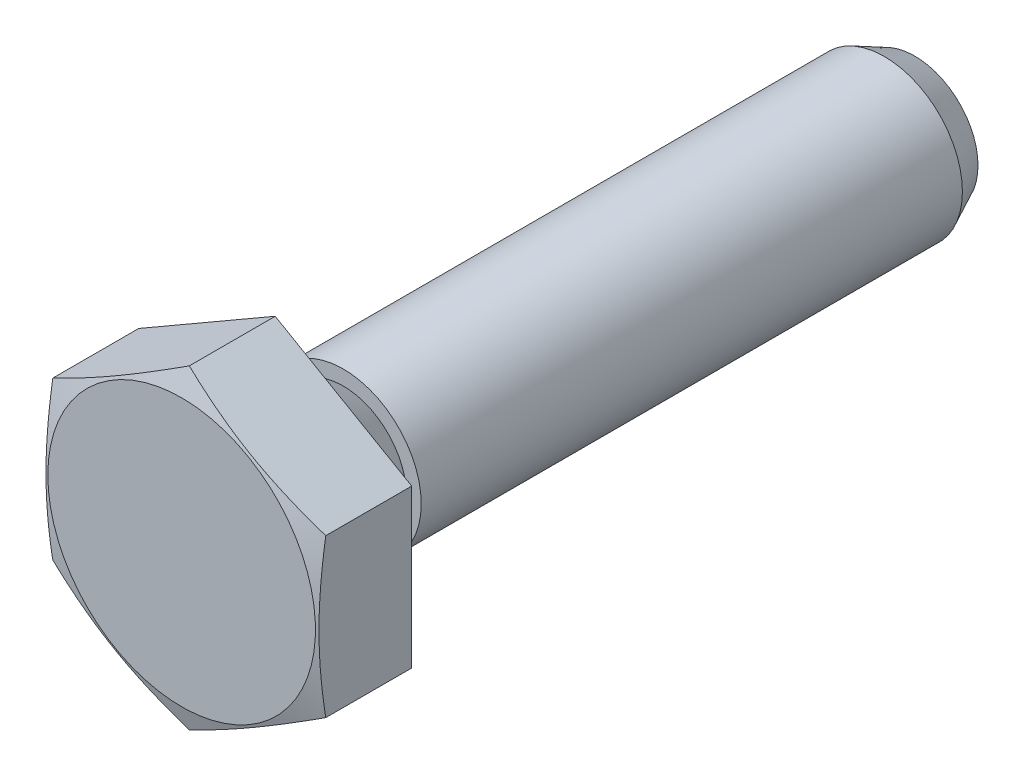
ISO-10303-21;
HEADER;
FILE_DESCRIPTION(('STEP AP214'),'2;1');
FILE_NAME('part.step','',(''),(''),'','','');
FILE_SCHEMA(('AUTOMOTIVE_DESIGN { 1 0 10303 214 1 1 1 1 }'));
ENDSEC;
DATA;
#1=APPLICATION_CONTEXT('core data for automotive mechanical design processes');
#2=APPLICATION_PROTOCOL_DEFINITION('international standard','automotive_design',2000,#1);
#3=PRODUCT_CONTEXT('',#1,'mechanical');
#4=PRODUCT('Part','Part','',(#3));
#5=PRODUCT_RELATED_PRODUCT_CATEGORY('part','',(#4));
#6=PRODUCT_DEFINITION_FORMATION('','',#4);
#7=PRODUCT_DEFINITION_CONTEXT('part definition',#1,'design');
#8=PRODUCT_DEFINITION('design','',#6,#7);
#9=PRODUCT_DEFINITION_SHAPE('','',#8);
#10=(LENGTH_UNIT() NAMED_UNIT(*) SI_UNIT(.MILLI.,.METRE.));
#11=(NAMED_UNIT(*) PLANE_ANGLE_UNIT() SI_UNIT($,.RADIAN.));
#12=(NAMED_UNIT(*) SI_UNIT($,.STERADIAN.) SOLID_ANGLE_UNIT());
#13=UNCERTAINTY_MEASURE_WITH_UNIT(LENGTH_MEASURE(1.E-05),#10,'distance_accuracy_value','');
#14=(GEOMETRIC_REPRESENTATION_CONTEXT(3) GLOBAL_UNCERTAINTY_ASSIGNED_CONTEXT((#13)) GLOBAL_UNIT_ASSIGNED_CONTEXT((#10,
#11,#12)) REPRESENTATION_CONTEXT('',''));
#15=CARTESIAN_POINT('',(0.,0.,0.));
#16=DIRECTION('',(0.,0.,1.));
#17=DIRECTION('',(1.,0.,0.));
#18=AXIS2_PLACEMENT_3D('',#15,#16,#17);
#19=CARTESIAN_POINT('',(0.,0.,0.399999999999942));
#20=DIRECTION('',(0.,0.,1.));
#21=DIRECTION('',(1.,0.,0.));
#22=AXIS2_PLACEMENT_3D('',#19,#20,#21);
#23=TOROIDAL_SURFACE('',#22,2.55,0.4);
#24=CARTESIAN_POINT('',(0.,0.,0.399999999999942));
#25=DIRECTION('',(0.,0.,1.));
#26=DIRECTION('',(1.,0.,0.));
#27=AXIS2_PLACEMENT_3D('',#24,#25,#26);
#28=CIRCLE('',#27,2.95);
#29=CARTESIAN_POINT('',(2.95,0.,0.399999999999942));
#30=VERTEX_POINT('',#29);
#31=EDGE_CURVE('E11',#30,#30,#28,.T.);
#32=ORIENTED_EDGE('',*,*,#31,.F.);
#33=EDGE_LOOP('',(#32));
#34=FACE_BOUND('',#33,.T.);
#35=CARTESIAN_POINT('',(0.,0.,0.));
#36=DIRECTION('',(0.,0.,1.));
#37=DIRECTION('',(1.,0.,0.));
#38=AXIS2_PLACEMENT_3D('',#35,#36,#37);
#39=CIRCLE('',#38,2.55);
#40=CARTESIAN_POINT('',(2.55,0.,0.));
#41=VERTEX_POINT('',#40);
#42=EDGE_CURVE('E24',#41,#41,#39,.T.);
#43=ORIENTED_EDGE('',*,*,#42,.T.);
#44=EDGE_LOOP('',(#43));
#45=FACE_BOUND('',#44,.T.);
#46=ADVANCED_FACE('F17',(#34,#45),#23,.T.);
#47=CARTESIAN_POINT('',(0.,2.55,0.));
#48=DIRECTION('',(0.,0.,-1.));
#49=DIRECTION('',(-1.,0.,0.));
#50=AXIS2_PLACEMENT_3D('',#47,#48,#49);
#51=PLANE('',#50);
#52=CARTESIAN_POINT('',(0.,0.,0.));
#53=DIRECTION('',(0.,0.,1.));
#54=DIRECTION('',(1.,0.,0.));
#55=AXIS2_PLACEMENT_3D('',#52,#53,#54);
#56=CIRCLE('',#55,2.2);
#57=CARTESIAN_POINT('',(2.2,0.,0.));
#58=VERTEX_POINT('',#57);
#59=EDGE_CURVE('E118',#58,#58,#56,.T.);
#60=ORIENTED_EDGE('',*,*,#59,.T.);
#61=EDGE_LOOP('',(#60));
#62=FACE_BOUND('',#61,.T.);
#63=ORIENTED_EDGE('',*,*,#42,.F.);
#64=EDGE_LOOP('',(#63));
#65=FACE_BOUND('',#64,.T.);
#66=ADVANCED_FACE('F124',(#62,#65),#51,.T.);
#67=CARTESIAN_POINT('',(0.,0.,-0.200000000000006));
#68=DIRECTION('',(0.,0.,1.));
#69=DIRECTION('',(1.,0.,0.));
#70=AXIS2_PLACEMENT_3D('',#67,#68,#69);
#71=TOROIDAL_SURFACE('',#70,2.2,0.2);
#72=CARTESIAN_POINT('',(0.,0.,-0.200000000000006));
#73=DIRECTION('',(0.,0.,1.));
#74=DIRECTION('',(1.,0.,0.));
#75=AXIS2_PLACEMENT_3D('',#72,#73,#74);
#76=CIRCLE('',#75,2.);
#77=CARTESIAN_POINT('',(1.99999999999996,0.,-0.200000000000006));
#78=VERTEX_POINT('',#77);
#79=EDGE_CURVE('E115',#78,#78,#76,.T.);
#80=ORIENTED_EDGE('',*,*,#79,.T.);
#81=EDGE_LOOP('',(#80));
#82=FACE_BOUND('',#81,.T.);
#83=ORIENTED_EDGE('',*,*,#59,.F.);
#84=EDGE_LOOP('',(#83));
#85=FACE_BOUND('',#84,.T.);
#86=ADVANCED_FACE('F126',(#82,#85),#71,.F.);
#87=CARTESIAN_POINT('',(0.,0.,0.399999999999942));
#88=DIRECTION('',(0.,0.,1.));
#89=DIRECTION('',(1.,0.,0.));
#90=AXIS2_PLACEMENT_3D('',#87,#88,#89);
#91=CYLINDRICAL_SURFACE('',#90,2.);
#92=CARTESIAN_POINT('',(0.,-1.66533453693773E-13,-0.687769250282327));
#93=DIRECTION('',(0.,0.,1.));
#94=DIRECTION('',(1.,0.,0.));
#95=AXIS2_PLACEMENT_3D('',#92,#93,#94);
#96=CIRCLE('',#95,2.);
#97=CARTESIAN_POINT('',(2.,-1.66371690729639E-13,-0.687769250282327));
#98=VERTEX_POINT('',#97);
#99=EDGE_CURVE('E112',#98,#98,#96,.T.);
#100=ORIENTED_EDGE('',*,*,#99,.T.);
#101=EDGE_LOOP('',(#100));
#102=FACE_BOUND('',#101,.T.);
#103=ORIENTED_EDGE('',*,*,#79,.F.);
#104=EDGE_LOOP('',(#103));
#105=FACE_BOUND('',#104,.T.);
#106=ADVANCED_FACE('F133',(#102,#105),#91,.T.);
#107=CARTESIAN_POINT('',(0.,-1.66533453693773E-13,-0.687769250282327));
#108=DIRECTION('',(0.,0.,1.));
#109=DIRECTION('',(1.,0.,0.));
#110=AXIS2_PLACEMENT_3D('',#107,#108,#109);
#111=CONICAL_SURFACE('',#110,2.,0.523598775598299);
#112=CARTESIAN_POINT('',(0.,0.,-1.34400000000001));
#113=DIRECTION('',(0.,0.,1.));
#114=DIRECTION('',(1.,0.,0.));
#115=AXIS2_PLACEMENT_3D('',#112,#113,#114);
#116=CIRCLE('',#115,1.621125);
#117=CARTESIAN_POINT('',(1.621125,0.,-1.34400000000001));
#118=VERTEX_POINT('',#117);
#119=EDGE_CURVE('E109',#118,#118,#116,.T.);
#120=ORIENTED_EDGE('',*,*,#119,.T.);
#121=EDGE_LOOP('',(#120));
#122=FACE_BOUND('',#121,.T.);
#123=ORIENTED_EDGE('',*,*,#99,.F.);
#124=EDGE_LOOP('',(#123));
#125=FACE_BOUND('',#124,.T.);
#126=ADVANCED_FACE('F140',(#122,#125),#111,.T.);
#127=CARTESIAN_POINT('',(0.,1.621125,-1.34400000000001));
#128=DIRECTION('',(0.,0.,1.));
#129=DIRECTION('',(1.,0.,0.));
#130=AXIS2_PLACEMENT_3D('',#127,#128,#129);
#131=PLANE('',#130);
#132=CARTESIAN_POINT('',(0.,0.,-1.34400000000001));
#133=DIRECTION('',(0.,0.,1.));
#134=DIRECTION('',(1.,0.,0.));
#135=AXIS2_PLACEMENT_3D('',#132,#133,#134);
#136=CIRCLE('',#135,2.);
#137=CARTESIAN_POINT('',(2.,0.,-1.34400000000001));
#138=VERTEX_POINT('',#137);
#139=EDGE_CURVE('E106',#138,#138,#136,.T.);
#140=ORIENTED_EDGE('',*,*,#139,.T.);
#141=EDGE_LOOP('',(#140));
#142=FACE_BOUND('',#141,.T.);
#143=ORIENTED_EDGE('',*,*,#119,.F.);
#144=EDGE_LOOP('',(#143));
#145=FACE_BOUND('',#144,.T.);
#146=ADVANCED_FACE('F144',(#142,#145),#131,.T.);
#147=CARTESIAN_POINT('',(0.,0.,0.399999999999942));
#148=DIRECTION('',(0.,0.,1.));
#149=DIRECTION('',(1.,0.,0.));
#150=AXIS2_PLACEMENT_3D('',#147,#148,#149);
#151=CYLINDRICAL_SURFACE('',#150,2.);
#152=CARTESIAN_POINT('',(0.,0.,-15.221125));
#153=DIRECTION('',(0.,0.,1.));
#154=DIRECTION('',(1.,0.,0.));
#155=AXIS2_PLACEMENT_3D('',#152,#153,#154);
#156=CIRCLE('',#155,2.);
#157=CARTESIAN_POINT('',(2.,0.,-15.221125));
#158=VERTEX_POINT('',#157);
#159=EDGE_CURVE('E103',#158,#158,#156,.T.);
#160=ORIENTED_EDGE('',*,*,#159,.T.);
#161=EDGE_LOOP('',(#160));
#162=FACE_BOUND('',#161,.T.);
#163=ORIENTED_EDGE('',*,*,#139,.F.);
#164=EDGE_LOOP('',(#163));
#165=FACE_BOUND('',#164,.T.);
#166=ADVANCED_FACE('F148',(#162,#165),#151,.T.);
#167=CARTESIAN_POINT('',(0.,0.,-15.221125));
#168=DIRECTION('',(0.,0.,1.));
#169=DIRECTION('',(1.,0.,0.));
#170=AXIS2_PLACEMENT_3D('',#167,#168,#169);
#171=CONICAL_SURFACE('',#170,2.,0.45273988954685);
#172=CARTESIAN_POINT('',(0.,3.33066907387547E-13,-16.0000000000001));
#173=DIRECTION('',(0.,0.,1.));
#174=DIRECTION('',(1.,0.,0.));
#175=AXIS2_PLACEMENT_3D('',#172,#173,#174);
#176=CIRCLE('',#175,1.621125);
#177=CARTESIAN_POINT('',(1.621125,3.33198026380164E-13,-16.0000000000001));
#178=VERTEX_POINT('',#177);
#179=EDGE_CURVE('E100',#178,#178,#176,.T.);
#180=ORIENTED_EDGE('',*,*,#179,.T.);
#181=EDGE_LOOP('',(#180));
#182=FACE_BOUND('',#181,.T.);
#183=ORIENTED_EDGE('',*,*,#159,.F.);
#184=EDGE_LOOP('',(#183));
#185=FACE_BOUND('',#184,.T.);
#186=ADVANCED_FACE('F152',(#182,#185),#171,.T.);
#187=CARTESIAN_POINT('',(0.,1.62112499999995,-16.0000000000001));
#188=DIRECTION('',(0.,0.,-1.));
#189=DIRECTION('',(-1.,0.,0.));
#190=AXIS2_PLACEMENT_3D('',#187,#188,#189);
#191=PLANE('',#190);
#192=ORIENTED_EDGE('',*,*,#179,.F.);
#193=EDGE_LOOP('',(#192));
#194=FACE_BOUND('',#193,.T.);
#195=ADVANCED_FACE('F156',(#194),#191,.T.);
#196=CARTESIAN_POINT('',(-3.5,-2.020725,0.399999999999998));
#197=DIRECTION('',(0.,0.,-1.));
#198=DIRECTION('',(-1.,0.,0.));
#199=AXIS2_PLACEMENT_3D('',#196,#197,#198);
#200=PLANE('',#199);
#201=DIRECTION('',(0.,-1.,0.));
#202=VECTOR('',#201,1.);
#203=CARTESIAN_POINT('',(-3.50000000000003,2.020725,0.399999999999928));
#204=LINE('',#203,#202);
#205=CARTESIAN_POINT('',(-3.50000000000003,2.020725,0.399999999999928));
#206=VERTEX_POINT('',#205);
#207=CARTESIAN_POINT('',(-3.5,-2.020725,0.399999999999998));
#208=VERTEX_POINT('',#207);
#209=EDGE_CURVE('E83',#206,#208,#204,.T.);
#210=ORIENTED_EDGE('',*,*,#209,.F.);
#211=DIRECTION('',(0.866025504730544,0.49999982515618,0.));
#212=VECTOR('',#211,1.);
#213=CARTESIAN_POINT('',(-3.50000000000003,2.020725,0.399999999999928));
#214=LINE('',#213,#212);
#215=CARTESIAN_POINT('',(0.,4.04145,0.400000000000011));
#216=VERTEX_POINT('',#215);
#217=EDGE_CURVE('E88',#206,#216,#214,.T.);
#218=ORIENTED_EDGE('',*,*,#217,.T.);
#219=DIRECTION('',(0.866025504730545,-0.49999982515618,0.));
#220=VECTOR('',#219,1.);
#221=CARTESIAN_POINT('',(0.,4.04145,0.400000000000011));
#222=LINE('',#221,#220);
#223=CARTESIAN_POINT('',(3.50000000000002,2.020725,0.399999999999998));
#224=VERTEX_POINT('',#223);
#225=EDGE_CURVE('E94',#216,#224,#222,.T.);
#226=ORIENTED_EDGE('',*,*,#225,.T.);
#227=DIRECTION('',(0.,-1.,0.));
#228=VECTOR('',#227,1.);
#229=CARTESIAN_POINT('',(3.50000000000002,2.020725,0.399999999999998));
#230=LINE('',#229,#228);
#231=CARTESIAN_POINT('',(3.5,-2.020725,0.399999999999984));
#232=VERTEX_POINT('',#231);
#233=EDGE_CURVE('E246',#224,#232,#230,.T.);
#234=ORIENTED_EDGE('',*,*,#233,.T.);
#235=DIRECTION('',(-0.866025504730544,-0.49999982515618,0.));
#236=VECTOR('',#235,1.);
#237=CARTESIAN_POINT('',(3.5,-2.020725,0.399999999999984));
#238=LINE('',#237,#236);
#239=CARTESIAN_POINT('',(0.,-4.04145,0.399999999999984));
#240=VERTEX_POINT('',#239);
#241=EDGE_CURVE('E232',#232,#240,#238,.T.);
#242=ORIENTED_EDGE('',*,*,#241,.T.);
#243=DIRECTION('',(-0.866025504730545,0.49999982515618,0.));
#244=VECTOR('',#243,1.);
#245=CARTESIAN_POINT('',(0.,-4.04145,0.399999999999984));
#246=LINE('',#245,#244);
#247=EDGE_CURVE('E230',#240,#208,#246,.T.);
#248=ORIENTED_EDGE('',*,*,#247,.T.);
#249=EDGE_LOOP('',(#210,#218,#226,#234,#242,#248));
#250=FACE_BOUND('',#249,.T.);
#251=ORIENTED_EDGE('',*,*,#31,.T.);
#252=EDGE_LOOP('',(#251));
#253=FACE_BOUND('',#252,.T.);
#254=ADVANCED_FACE('F160',(#250,#253),#200,.T.);
#255=CARTESIAN_POINT('',(-3.50000000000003,2.020725,0.399999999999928));
#256=DIRECTION('',(-1.,0.,0.));
#257=DIRECTION('',(0.,0.,1.));
#258=AXIS2_PLACEMENT_3D('',#255,#256,#257);
#259=PLANE('',#258);
#260=CARTESIAN_POINT('',(-3.50000000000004,2.41000695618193,2.53652052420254));
#261=CARTESIAN_POINT('',(-3.50000000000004,2.24716371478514,2.56625726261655));
#262=CARTESIAN_POINT('',(-3.50000000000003,2.08393338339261,2.59404247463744));
#263=CARTESIAN_POINT('',(-3.50000000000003,1.75663223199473,2.64475875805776));
#264=CARTESIAN_POINT('',(-3.50000000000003,1.59256099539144,2.66768712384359));
#265=CARTESIAN_POINT('',(-3.50000000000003,1.26383550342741,2.70768606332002));
#266=CARTESIAN_POINT('',(-3.50000000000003,1.09918187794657,2.72476170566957));
#267=CARTESIAN_POINT('',(-3.50000000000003,0.769336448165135,2.7521597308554));
#268=CARTESIAN_POINT('',(-3.50000000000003,0.604144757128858,2.76248345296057));
#269=CARTESIAN_POINT('',(-3.50000000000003,0.275800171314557,2.77563847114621));
#270=CARTESIAN_POINT('',(-3.50000000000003,0.112651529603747,2.77857379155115));
#271=CARTESIAN_POINT('',(-3.50000000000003,-0.213618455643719,2.77705838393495));
#272=CARTESIAN_POINT('',(-3.50000000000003,-0.376739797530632,2.77260730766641));
#273=CARTESIAN_POINT('',(-3.50000000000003,-0.70257703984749,2.75661487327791));
#274=CARTESIAN_POINT('',(-3.50000000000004,-0.86529304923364,2.74507568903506));
#275=CARTESIAN_POINT('',(-3.50000000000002,-1.19013728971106,2.7155987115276));
#276=CARTESIAN_POINT('',(-3.5,-1.35226550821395,2.69766078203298));
#277=CARTESIAN_POINT('',(-3.5,-1.67493288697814,2.65639848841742));
#278=CARTESIAN_POINT('',(-3.50000000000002,-1.83547589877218,2.63310379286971));
#279=CARTESIAN_POINT('',(-3.50000000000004,-2.15583270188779,2.5819928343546));
#280=CARTESIAN_POINT('',(-3.50000000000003,-2.31564649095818,2.55417655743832));
#281=CARTESIAN_POINT('',(-3.50000000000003,-2.63469880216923,2.49483977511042));
#282=CARTESIAN_POINT('',(-3.50000000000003,-2.79393682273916,2.46331659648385));
#283=CARTESIAN_POINT('',(-3.50000000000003,-3.11179609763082,2.3972955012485));
#284=CARTESIAN_POINT('',(-3.50000000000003,-3.2704173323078,2.36279749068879));
#285=CARTESIAN_POINT('',(-3.50000000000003,-3.58972025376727,2.29082382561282));
#286=CARTESIAN_POINT('',(-3.50000000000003,-3.75039296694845,2.25330855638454));
#287=CARTESIAN_POINT('',(-3.50000000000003,-4.07126226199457,2.17629280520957));
#288=CARTESIAN_POINT('',(-3.50000000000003,-4.23145883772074,2.13679229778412));
#289=CARTESIAN_POINT('',(-3.50000000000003,-4.55111494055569,2.0562758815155));
#290=CARTESIAN_POINT('',(-3.50000000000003,-4.71057530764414,2.01526329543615));
#291=CARTESIAN_POINT('',(-3.50000000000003,-5.0291442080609,1.93193208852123));
#292=CARTESIAN_POINT('',(-3.50000000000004,-5.18825276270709,1.88961354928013));
#293=CARTESIAN_POINT('',(-3.50000000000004,-5.34722072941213,1.84678272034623));
#294=B_SPLINE_CURVE_WITH_KNOTS('',3,(#260,#261,#262,#263,#264,#265,#266,#267,#268,#269,#270,
#271,#272,#273,#274,#275,#276,#277,#278,#279,#280,#281,#282,#283,#284,#285,#286,#287,#288,#289,
#290,#291,#292,#293),.UNSPECIFIED.,.F.,.F.,(4,2,2,2,2,2,2,2,2,2,2,2,2,2,2,2,4),(0.,
0.49664189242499,0.993559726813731,1.4900461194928,1.98643400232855,2.47579292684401,
2.96517492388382,3.45440690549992,3.94364930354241,4.43024464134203,4.91684148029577,
5.40379140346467,5.89075671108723,6.38572406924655,6.88069778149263,7.37464199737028,
7.86855541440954),.UNSPECIFIED.);
#295=CARTESIAN_POINT('',(-3.50000000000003,2.020725,2.60352946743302));
#296=VERTEX_POINT('',#295);
#297=CARTESIAN_POINT('',(-3.50000000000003,-2.02072500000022,2.603529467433));
#298=VERTEX_POINT('',#297);
#299=EDGE_CURVE('E72',#296,#298,#294,.T.);
#300=ORIENTED_EDGE('',*,*,#299,.F.);
#301=DIRECTION('',(0.,0.,1.));
#302=VECTOR('',#301,1.);
#303=CARTESIAN_POINT('',(-3.50000000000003,2.020725,0.399999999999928));
#304=LINE('',#303,#302);
#305=EDGE_CURVE('E81',#206,#296,#304,.T.);
#306=ORIENTED_EDGE('',*,*,#305,.F.);
#307=ORIENTED_EDGE('',*,*,#209,.T.);
#308=DIRECTION('',(0.,0.,1.));
#309=VECTOR('',#308,1.);
#310=CARTESIAN_POINT('',(-3.5,-2.020725,0.399999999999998));
#311=LINE('',#310,#309);
#312=EDGE_CURVE('E39',#208,#298,#311,.T.);
#313=ORIENTED_EDGE('',*,*,#312,.T.);
#314=EDGE_LOOP('',(#300,#306,#307,#313));
#315=FACE_BOUND('',#314,.T.);
#316=ADVANCED_FACE('F79',(#315),#259,.T.);
#317=CARTESIAN_POINT('',(0.,-4.04145,0.399999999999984));
#318=DIRECTION('',(0.49999982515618,0.866025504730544,0.));
#319=DIRECTION('',(0.866025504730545,-0.49999982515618,0.));
#320=AXIS2_PLACEMENT_3D('',#317,#318,#319);
#321=PLANE('',#320);
#322=DIRECTION('',(0.,0.,1.));
#323=VECTOR('',#322,1.);
#324=CARTESIAN_POINT('',(0.,-4.04145,0.399999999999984));
#325=LINE('',#324,#323);
#326=CARTESIAN_POINT('',(0.,-4.04145,2.60352992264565));
#327=VERTEX_POINT('',#326);
#328=EDGE_CURVE('E237',#240,#327,#325,.T.);
#329=ORIENTED_EDGE('',*,*,#328,.T.);
#330=CARTESIAN_POINT('',(1.99999961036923E-07,-4.04145011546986,2.6035298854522));
#331=CARTESIAN_POINT('',(-0.145132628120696,-3.95765767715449,2.63052934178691));
#332=CARTESIAN_POINT('',(-0.29064281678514,-3.87364736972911,2.65506654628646));
#333=CARTESIAN_POINT('',(-0.582404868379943,-3.70519854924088,2.69820753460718));
#334=CARTESIAN_POINT('',(-0.728657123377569,-3.62075980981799,2.71680775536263));
#335=CARTESIAN_POINT('',(-1.020627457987,-3.45219073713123,2.74691878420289));
#336=CARTESIAN_POINT('',(-1.16634143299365,-3.36806277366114,2.75848123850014));
#337=CARTESIAN_POINT('',(-1.45803700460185,-3.19965233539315,2.77398763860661));
#338=CARTESIAN_POINT('',(-1.60401851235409,-3.11536991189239,2.77793377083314));
#339=CARTESIAN_POINT('',(-1.89598152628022,-2.94680506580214,2.77793372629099));
#340=CARTESIAN_POINT('',(-2.0419630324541,-2.86252264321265,2.77398754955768));
#341=CARTESIAN_POINT('',(-2.33365859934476,-2.69411220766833,2.75848106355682));
#342=CARTESIAN_POINT('',(-2.47937257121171,-2.60998424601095,2.74691856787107));
#343=CARTESIAN_POINT('',(-2.77134289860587,-2.44141517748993,2.71680746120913));
#344=CARTESIAN_POINT('',(-2.91759514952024,-2.35697644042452,2.69820720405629));
#345=CARTESIAN_POINT('',(-3.20935719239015,-2.18852762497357,2.65506614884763));
#346=CARTESIAN_POINT('',(-3.35486737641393,-2.10451732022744,2.63052891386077));
#347=CARTESIAN_POINT('',(-3.50000020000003,-2.02072488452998,2.60352943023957));
#348=B_SPLINE_CURVE_WITH_KNOTS('',3,(#330,#331,#332,#333,#334,#335,#336,#337,#338,#339,#340,
#341,#342,#343,#344,#345,#346,#347),.UNSPECIFIED.,.F.,.F.,(4,2,2,2,2,2,2,2,4),(0.,
0.50927771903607,1.01886050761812,1.5246571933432,2.03030865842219,2.53596012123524,
3.04175680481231,3.55133959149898,4.06061730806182),.UNSPECIFIED.);
#349=EDGE_CURVE('E84',#327,#298,#348,.T.);
#350=ORIENTED_EDGE('',*,*,#349,.T.);
#351=ORIENTED_EDGE('',*,*,#312,.F.);
#352=ORIENTED_EDGE('',*,*,#247,.F.);
#353=EDGE_LOOP('',(#329,#350,#351,#352));
#354=FACE_BOUND('',#353,.T.);
#355=ADVANCED_FACE('F165',(#354),#321,.F.);
#356=CARTESIAN_POINT('',(3.5,-2.020725,0.399999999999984));
#357=DIRECTION('',(-0.49999982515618,0.866025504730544,0.));
#358=DIRECTION('',(0.866025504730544,0.49999982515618,0.));
#359=AXIS2_PLACEMENT_3D('',#356,#357,#358);
#360=PLANE('',#359);
#361=DIRECTION('',(0.,0.,1.));
#362=VECTOR('',#361,1.);
#363=CARTESIAN_POINT('',(3.5,-2.020725,0.399999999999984));
#364=LINE('',#363,#362);
#365=CARTESIAN_POINT('',(3.5,-2.020725,2.603529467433));
#366=VERTEX_POINT('',#365);
#367=EDGE_CURVE('E240',#232,#366,#364,.T.);
#368=ORIENTED_EDGE('',*,*,#367,.T.);
#369=CARTESIAN_POINT('',(3.50000020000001,-2.02072488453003,2.6035294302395));
#370=CARTESIAN_POINT('',(3.35486737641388,-2.10451732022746,2.63052891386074));
#371=CARTESIAN_POINT('',(3.20935719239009,-2.18852762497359,2.65506614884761));
#372=CARTESIAN_POINT('',(2.91759514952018,-2.35697644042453,2.69820720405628));
#373=CARTESIAN_POINT('',(2.7713428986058,-2.44141517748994,2.71680746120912));
#374=CARTESIAN_POINT('',(2.47937257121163,-2.60998424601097,2.74691856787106));
#375=CARTESIAN_POINT('',(2.33365859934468,-2.69411220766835,2.75848106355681));
#376=CARTESIAN_POINT('',(2.04196303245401,-2.86252264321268,2.77398754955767));
#377=CARTESIAN_POINT('',(1.89598152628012,-2.94680506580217,2.77793372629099));
#378=CARTESIAN_POINT('',(1.60401851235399,-3.11536991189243,2.77793377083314));
#379=CARTESIAN_POINT('',(1.45803700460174,-3.19965233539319,2.7739876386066));
#380=CARTESIAN_POINT('',(1.16634143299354,-3.36806277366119,2.75848123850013));
#381=CARTESIAN_POINT('',(1.02062745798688,-3.45219073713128,2.74691878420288));
#382=CARTESIAN_POINT('',(0.728657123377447,-3.62075980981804,2.71680775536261));
#383=CARTESIAN_POINT('',(0.582404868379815,-3.70519854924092,2.69820753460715));
#384=CARTESIAN_POINT('',(0.290642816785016,-3.87364736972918,2.65506654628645));
#385=CARTESIAN_POINT('',(0.145132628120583,-3.95765767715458,2.63052934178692));
#386=CARTESIAN_POINT('',(-2.0000004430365E-07,-4.04145011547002,2.60352988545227));
#387=B_SPLINE_CURVE_WITH_KNOTS('',3,(#369,#370,#371,#372,#373,#374,#375,#376,#377,#378,#379,
#380,#381,#382,#383,#384,#385,#386),.UNSPECIFIED.,.F.,.F.,(4,2,2,2,2,2,2,2,4),(0.,
0.509277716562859,1.01886050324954,1.52465718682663,2.03030864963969,2.5359601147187,
3.04175680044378,3.55133958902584,4.06061730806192),.UNSPECIFIED.);
#388=EDGE_CURVE('E203',#366,#327,#387,.T.);
#389=ORIENTED_EDGE('',*,*,#388,.T.);
#390=ORIENTED_EDGE('',*,*,#328,.F.);
#391=ORIENTED_EDGE('',*,*,#241,.F.);
#392=EDGE_LOOP('',(#368,#389,#390,#391));
#393=FACE_BOUND('',#392,.T.);
#394=ADVANCED_FACE('F208',(#393),#360,.F.);
#395=CARTESIAN_POINT('',(3.50000000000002,2.020725,0.399999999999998));
#396=DIRECTION('',(-1.,0.,0.));
#397=DIRECTION('',(0.,0.,1.));
#398=AXIS2_PLACEMENT_3D('',#395,#396,#397);
#399=PLANE('',#398);
#400=DIRECTION('',(0.,0.,1.));
#401=VECTOR('',#400,1.);
#402=CARTESIAN_POINT('',(3.50000000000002,2.020725,0.399999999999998));
#403=LINE('',#402,#401);
#404=CARTESIAN_POINT('',(3.49999999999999,2.020725,2.60352946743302));
#405=VERTEX_POINT('',#404);
#406=EDGE_CURVE('E92',#224,#405,#403,.T.);
#407=ORIENTED_EDGE('',*,*,#406,.T.);
#408=CARTESIAN_POINT('',(3.5,2.41000695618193,2.53652052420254));
#409=CARTESIAN_POINT('',(3.50000000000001,2.24716371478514,2.56625726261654));
#410=CARTESIAN_POINT('',(3.50000000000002,2.08393338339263,2.59404247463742));
#411=CARTESIAN_POINT('',(3.50000000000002,1.75663223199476,2.64475875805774));
#412=CARTESIAN_POINT('',(3.50000000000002,1.59256099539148,2.66768712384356));
#413=CARTESIAN_POINT('',(3.50000000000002,1.26383550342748,2.70768606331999));
#414=CARTESIAN_POINT('',(3.50000000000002,1.09918187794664,2.72476170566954));
#415=CARTESIAN_POINT('',(3.50000000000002,0.769336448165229,2.75215973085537));
#416=CARTESIAN_POINT('',(3.50000000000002,0.604144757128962,2.76248345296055));
#417=CARTESIAN_POINT('',(3.50000000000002,0.27580017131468,2.77563847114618));
#418=CARTESIAN_POINT('',(3.50000000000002,0.112651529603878,2.77857379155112));
#419=CARTESIAN_POINT('',(3.50000000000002,-0.213618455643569,2.77705838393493));
#420=CARTESIAN_POINT('',(3.50000000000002,-0.376739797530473,2.77260730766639));
#421=CARTESIAN_POINT('',(3.50000000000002,-0.702577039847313,2.7566148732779));
#422=CARTESIAN_POINT('',(3.50000000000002,-0.865293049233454,2.74507568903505));
#423=CARTESIAN_POINT('',(3.50000000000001,-1.19013728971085,2.7155987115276));
#424=CARTESIAN_POINT('',(3.5,-1.35226550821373,2.69766078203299));
#425=CARTESIAN_POINT('',(3.5,-1.67493288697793,2.65639848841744));
#426=CARTESIAN_POINT('',(3.50000000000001,-1.83547589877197,2.63310379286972));
#427=CARTESIAN_POINT('',(3.50000000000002,-2.1558327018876,2.58199283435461));
#428=CARTESIAN_POINT('',(3.50000000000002,-2.315646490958,2.55417655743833));
#429=CARTESIAN_POINT('',(3.50000000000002,-2.63469880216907,2.49483977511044));
#430=CARTESIAN_POINT('',(3.50000000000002,-2.793936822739,2.46331659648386));
#431=CARTESIAN_POINT('',(3.50000000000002,-3.11179609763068,2.39729550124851));
#432=CARTESIAN_POINT('',(3.50000000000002,-3.27041733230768,2.3627974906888));
#433=CARTESIAN_POINT('',(3.50000000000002,-3.58972025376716,2.29082382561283));
#434=CARTESIAN_POINT('',(3.50000000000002,-3.75039296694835,2.25330855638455));
#435=CARTESIAN_POINT('',(3.50000000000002,-4.07126226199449,2.17629280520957));
#436=CARTESIAN_POINT('',(3.50000000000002,-4.23145883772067,2.13679229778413));
#437=CARTESIAN_POINT('',(3.50000000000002,-4.55111494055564,2.0562758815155));
#438=CARTESIAN_POINT('',(3.50000000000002,-4.71057530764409,2.01526329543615));
#439=CARTESIAN_POINT('',(3.50000000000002,-5.02914420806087,1.93193208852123));
#440=CARTESIAN_POINT('',(3.50000000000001,-5.18825276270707,1.88961354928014));
#441=CARTESIAN_POINT('',(3.5,-5.34722072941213,1.84678272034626));
#442=B_SPLINE_CURVE_WITH_KNOTS('',3,(#408,#409,#410,#411,#412,#413,#414,#415,#416,#417,#418,
#419,#420,#421,#422,#423,#424,#425,#426,#427,#428,#429,#430,#431,#432,#433,#434,#435,#436,#437,
#438,#439,#440,#441),.UNSPECIFIED.,.F.,.F.,(4,2,2,2,2,2,2,2,2,2,2,2,2,2,2,2,4),(0.,
0.49664189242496,0.993559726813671,1.49004611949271,1.98643400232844,2.47579292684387,
2.96517492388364,3.45440690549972,3.94364930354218,4.43024464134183,4.91684148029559,
5.40379140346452,5.89075671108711,6.38572406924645,6.88069778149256,7.37464199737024,
7.86855541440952),.UNSPECIFIED.);
#443=EDGE_CURVE('E198',#405,#366,#442,.T.);
#444=ORIENTED_EDGE('',*,*,#443,.T.);
#445=ORIENTED_EDGE('',*,*,#367,.F.);
#446=ORIENTED_EDGE('',*,*,#233,.F.);
#447=EDGE_LOOP('',(#407,#444,#445,#446));
#448=FACE_BOUND('',#447,.T.);
#449=ADVANCED_FACE('F211',(#448),#399,.F.);
#450=CARTESIAN_POINT('',(0.,4.04145,0.400000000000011));
#451=DIRECTION('',(-0.49999982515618,-0.866025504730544,0.));
#452=DIRECTION('',(-0.866025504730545,0.49999982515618,0.));
#453=AXIS2_PLACEMENT_3D('',#450,#451,#452);
#454=PLANE('',#453);
#455=DIRECTION('',(0.,0.,1.));
#456=VECTOR('',#455,1.);
#457=CARTESIAN_POINT('',(0.,4.04145,0.400000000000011));
#458=LINE('',#457,#456);
#459=CARTESIAN_POINT('',(0.,4.04144999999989,2.60352992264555));
#460=VERTEX_POINT('',#459);
#461=EDGE_CURVE('E90',#216,#460,#458,.T.);
#462=ORIENTED_EDGE('',*,*,#461,.T.);
#463=CARTESIAN_POINT('',(-2.00000030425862E-07,4.04145011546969,2.60352988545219));
#464=CARTESIAN_POINT('',(0.145132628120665,3.9576576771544,2.63052934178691));
#465=CARTESIAN_POINT('',(0.290642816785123,3.87364736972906,2.65506654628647));
#466=CARTESIAN_POINT('',(0.582404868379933,3.70519854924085,2.69820753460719));
#467=CARTESIAN_POINT('',(0.728657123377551,3.62075980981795,2.71680775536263));
#468=CARTESIAN_POINT('',(1.02062745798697,3.45219073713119,2.74691878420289));
#469=CARTESIAN_POINT('',(1.16634143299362,3.36806277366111,2.75848123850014));
#470=CARTESIAN_POINT('',(1.45803700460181,3.19965233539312,2.77398763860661));
#471=CARTESIAN_POINT('',(1.60401851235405,3.11536991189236,2.77793377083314));
#472=CARTESIAN_POINT('',(1.89598152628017,2.94680506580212,2.77793372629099));
#473=CARTESIAN_POINT('',(2.04196303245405,2.86252264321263,2.77398754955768));
#474=CARTESIAN_POINT('',(2.3336585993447,2.69411220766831,2.75848106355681));
#475=CARTESIAN_POINT('',(2.47937257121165,2.60998424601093,2.74691856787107));
#476=CARTESIAN_POINT('',(2.7713428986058,2.44141517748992,2.71680746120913));
#477=CARTESIAN_POINT('',(2.91759514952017,2.35697644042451,2.69820720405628));
#478=CARTESIAN_POINT('',(3.20935719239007,2.18852762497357,2.65506614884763));
#479=CARTESIAN_POINT('',(3.35486737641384,2.10451732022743,2.63052891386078));
#480=CARTESIAN_POINT('',(3.50000019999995,2.02072488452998,2.60352943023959));
#481=B_SPLINE_CURVE_WITH_KNOTS('',3,(#463,#464,#465,#466,#467,#468,#469,#470,#471,#472,#473,
#474,#475,#476,#477,#478,#479,#480),.UNSPECIFIED.,.F.,.F.,(4,2,2,2,2,2,2,2,4),(0.,
0.50927771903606,1.0188605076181,1.52465719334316,2.03030865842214,2.53596012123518,
3.04175680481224,3.55133959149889,4.06061730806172),.UNSPECIFIED.);
#482=EDGE_CURVE('E31',#460,#405,#481,.T.);
#483=ORIENTED_EDGE('',*,*,#482,.T.);
#484=ORIENTED_EDGE('',*,*,#406,.F.);
#485=ORIENTED_EDGE('',*,*,#225,.F.);
#486=EDGE_LOOP('',(#462,#483,#484,#485));
#487=FACE_BOUND('',#486,.T.);
#488=ADVANCED_FACE('F215',(#487),#454,.F.);
#489=CARTESIAN_POINT('',(-3.50000000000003,2.020725,0.399999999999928));
#490=DIRECTION('',(0.49999982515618,-0.866025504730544,0.));
#491=DIRECTION('',(-0.866025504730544,-0.49999982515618,0.));
#492=AXIS2_PLACEMENT_3D('',#489,#490,#491);
#493=PLANE('',#492);
#494=ORIENTED_EDGE('',*,*,#305,.T.);
#495=CARTESIAN_POINT('',(-3.50000020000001,2.02072488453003,2.60352943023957));
#496=CARTESIAN_POINT('',(-3.35486737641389,2.10451732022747,2.63052891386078));
#497=CARTESIAN_POINT('',(-3.2093571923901,2.1885276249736,2.65506614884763));
#498=CARTESIAN_POINT('',(-2.91759514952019,2.35697644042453,2.69820720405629));
#499=CARTESIAN_POINT('',(-2.77134289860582,2.44141517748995,2.71680746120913));
#500=CARTESIAN_POINT('',(-2.47937257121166,2.60998424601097,2.74691856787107));
#501=CARTESIAN_POINT('',(-2.33365859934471,2.69411220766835,2.75848106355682));
#502=CARTESIAN_POINT('',(-2.04196303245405,2.86252264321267,2.77398754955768));
#503=CARTESIAN_POINT('',(-1.89598152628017,2.94680506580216,2.777933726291));
#504=CARTESIAN_POINT('',(-1.60401851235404,3.11536991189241,2.77793377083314));
#505=CARTESIAN_POINT('',(-1.4580370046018,3.19965233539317,2.77398763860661));
#506=CARTESIAN_POINT('',(-1.1663414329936,3.36806277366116,2.75848123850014));
#507=CARTESIAN_POINT('',(-1.02062745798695,3.45219073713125,2.74691878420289));
#508=CARTESIAN_POINT('',(-0.728657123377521,3.62075980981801,2.71680775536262));
#509=CARTESIAN_POINT('',(-0.582404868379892,3.70519854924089,2.69820753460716));
#510=CARTESIAN_POINT('',(-0.290642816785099,3.87364736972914,2.65506654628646));
#511=CARTESIAN_POINT('',(-0.145132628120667,3.95765767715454,2.63052934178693));
#512=CARTESIAN_POINT('',(1.99999961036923E-07,4.04145011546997,2.60352988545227));
#513=B_SPLINE_CURVE_WITH_KNOTS('',3,(#495,#496,#497,#498,#499,#500,#501,#502,#503,#504,#505,
#506,#507,#508,#509,#510,#511,#512),.UNSPECIFIED.,.F.,.F.,(4,2,2,2,2,2,2,2,4),(0.,
0.509277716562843,1.01886050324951,1.52465718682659,2.03030864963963,2.53596011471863,
3.0417568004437,3.55133958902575,4.06061730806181),.UNSPECIFIED.);
#514=EDGE_CURVE('E68',#296,#460,#513,.T.);
#515=ORIENTED_EDGE('',*,*,#514,.T.);
#516=ORIENTED_EDGE('',*,*,#461,.F.);
#517=ORIENTED_EDGE('',*,*,#217,.F.);
#518=EDGE_LOOP('',(#494,#515,#516,#517));
#519=FACE_BOUND('',#518,.T.);
#520=ADVANCED_FACE('F86',(#519),#493,.F.);
#521=CARTESIAN_POINT('',(0.,0.,2.57749454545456));
#522=DIRECTION('',(0.,0.,-1.));
#523=DIRECTION('',(-1.,0.,0.));
#524=AXIS2_PLACEMENT_3D('',#521,#522,#523);
#525=CONICAL_SURFACE('',#524,4.122279,1.25918561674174);
#526=ORIENTED_EDGE('',*,*,#299,.T.);
#527=ORIENTED_EDGE('',*,*,#349,.F.);
#528=ORIENTED_EDGE('',*,*,#388,.F.);
#529=ORIENTED_EDGE('',*,*,#443,.F.);
#530=ORIENTED_EDGE('',*,*,#482,.F.);
#531=ORIENTED_EDGE('',*,*,#514,.F.);
#532=EDGE_LOOP('',(#526,#527,#528,#529,#530,#531));
#533=FACE_BOUND('',#532,.T.);
#534=CARTESIAN_POINT('',(0.,1.66533453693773E-13,2.80000000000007));
#535=DIRECTION('',(0.,0.,-1.));
#536=DIRECTION('',(-1.,0.,0.));
#537=AXIS2_PLACEMENT_3D('',#534,#535,#536);
#538=CIRCLE('',#537,3.43149225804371);
#539=CARTESIAN_POINT('',(-3.43149225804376,1.66250700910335E-13,2.80000000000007));
#540=VERTEX_POINT('',#539);
#541=EDGE_CURVE('E76',#540,#540,#538,.F.);
#542=ORIENTED_EDGE('',*,*,#541,.F.);
#543=EDGE_LOOP('',(#542));
#544=FACE_BOUND('',#543,.T.);
#545=ADVANCED_FACE('F70',(#533,#544),#525,.T.);
#546=CARTESIAN_POINT('',(-3.5,-2.020725,2.79999999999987));
#547=DIRECTION('',(0.,0.,-1.));
#548=DIRECTION('',(-1.,0.,0.));
#549=AXIS2_PLACEMENT_3D('',#546,#547,#548);
#550=PLANE('',#549);
#551=ORIENTED_EDGE('',*,*,#541,.T.);
#552=EDGE_LOOP('',(#551));
#553=FACE_BOUND('',#552,.T.);
#554=ADVANCED_FACE('F181',(#553),#550,.F.);
#555=CLOSED_SHELL('',(#46,#66,#86,#106,#126,#146,#166,#186,#195,#254,#316,#355,#394,#449,#488,
#520,#545,#554));
#556=MANIFOLD_SOLID_BREP('B1',#555);
#557=ADVANCED_BREP_SHAPE_REPRESENTATION('',(#18,#556),#14);
#558=SHAPE_DEFINITION_REPRESENTATION(#9,#557);
ENDSEC;
END-ISO-10303-21;
